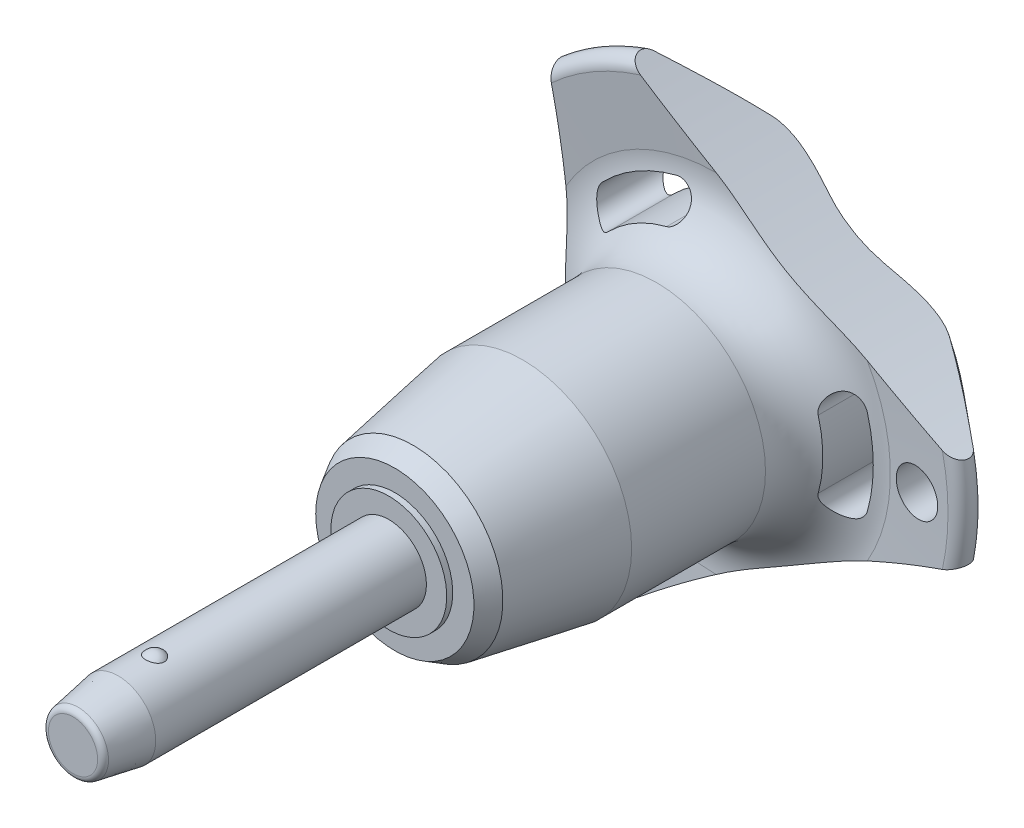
from build123d import *

# Parameters (mm, degrees)
SKETCH1_R           = 2.5
BOSS_EXTRUDE1_DEPTH = 15
SKETCH2_R           = 2.1
BOSS_EXTRUDE2_DEPTH = 26.7
BOSS_EXTRUDE3_START = 6
SKETCH1_2_R         = 2.5
BOSS_EXTRUDE3_DEPTH = 6
CHAMFER1_SIZE       = 3
CHAMFER1_SIZE2      = 0.528980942
FILLET1_R           = 0.4
SKETCH6_R           = 79.96
CUT_EXTRUDE1_DEPTH  = 48.854696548
CIRPATTERN1_COUNT   = 3
SKETCH7_R           = 1.5
CUT_EXTRUDE2_DEPTH  = 48.535566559


with BuildPart() as part:
    # Sketch1 → Boss-Extrude1 (new body)
    with BuildSketch(Plane.XY):
        Circle(SKETCH1_R)
    extrude(amount=-BOSS_EXTRUDE1_DEPTH)

    # Sketch2 → Boss-Extrude2 (add)
    with BuildSketch(Plane(origin=(0, 0, -15), x_dir=(-1, 0, 0), z_dir=(0, 0, -1))):
        Circle(SKETCH2_R)
    extrude(amount=BOSS_EXTRUDE2_DEPTH)

    # Sketch3 → Revolve1 (revolve)
    with BuildSketch(Plane(origin=(0, 0, 0), x_dir=(0, 0, -1), z_dir=(1, 0, 0))):
        with BuildLine():
            Line((-0.580947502, 2.75), (-0.580947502, 1.15))
            ThreePointArc((-0.580947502, 1.15), (0.219052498, 1.95), (-0.580947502, 2.75))
        make_face()
        with BuildLine():
            Line((-0.580947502, -1.15), (-0.580947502, -2.75))
            ThreePointArc((-0.580947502, -2.75), (0.219052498, -1.95), (-0.580947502, -1.15))
        make_face()
    revolve(axis=Axis((0, -1.15, 0.580947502), (0, 1, 0)))

    # Sketch1_2 → Boss-Extrude3 (add)
    with BuildSketch(Plane.XY.offset(BOSS_EXTRUDE3_START)):
        Circle(SKETCH1_2_R)
    extrude(amount=-BOSS_EXTRUDE3_DEPTH)

    # Chamfer1
    chamfer1_edges = [part.edges().sort_by_distance(p)[0] for p in [
        (-2.5, 0, 6),
    ]]
    chamfer1_side = [part.faces().sort_by_distance(p)[0] for p in [
        (-2.5, 0, -4.5),
    ]]
    chamfer(chamfer1_edges, length=CHAMFER1_SIZE, length2=CHAMFER1_SIZE2, reference=chamfer1_side[0])

    # Fillet1
    fillet1_edges = [part.edges().sort_by_distance(p)[0] for p in [
        (-1.971019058, 0, 6),
        (2.1, 0, -41.7),
    ]]
    fillet(fillet1_edges, radius=FILLET1_R)

    # Sketch4 → Revolve2 (revolve)
    with BuildSketch(Plane(origin=(0, 0, 0), x_dir=(0, 0, -1), z_dir=(1, 0, 0)), mode=Mode.PRIVATE) as revolve2_sk:
        Polygon((15, 0), (15, 3.851837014), (15.4, 3.851837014), (15.4, 5.26161122), (16.620900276, 5.966498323), (23.9, 7.25), (32.8, 7.25), (32.8, 0), align=None)
    revolve(revolve2_sk.sketch.rotate(Axis((0, 0, -32.8), (0, 0, 1)), 90), axis=Axis((0, 0, -32.8), (0, 0, 1)))

    # Sketch5 → Revolve3 (revolve)
    with BuildSketch(Plane(origin=(0, 0, 0), x_dir=(0, 0, -1), z_dir=(1, 0, 0)), mode=Mode.PRIVATE) as revolve3_sk:
        with BuildLine():
            Line((36.78715932, 11.570250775), (36.452568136, 15.735949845))
            ThreePointArc((36.452568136, 15.735949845), (36.946485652, 16.540188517), (37.862835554, 16.314230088))
            Line((37.862835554, 16.314230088), (41.326414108, 12.186497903))
            ThreePointArc((41.326414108, 12.186497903), (41.7, 11.109282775), (41.261488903, 10.056825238))
            ThreePointArc((41.261488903, 10.056825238), (38.289873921, 5.413681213), (37.25, 0))
            Line((37.25, 0), (32.8, 0))
            Line((32.8, 0), (32.8, 7.25))
            ThreePointArc((32.8, 7.25), (35.739473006, 8.537160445), (36.78715932, 11.570250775))
        make_face()
    revolve(revolve3_sk.sketch.rotate(Axis((0, 0, -37.25), (0, 0, 1)), 90), axis=Axis((0, 0, -37.25), (0, 0, 1)))

    # Sketch6 → Cut-Extrude1 (cut, through all)
    with BuildSketch(Plane.XY):
        with Locations((-89.76, 0)):
            Circle(SKETCH6_R)
        with BuildLine():
            ThreePointArc((10.099921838, -2.834717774), (10.490188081, 0), (10.099921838, 2.834717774))
            ThreePointArc((10.099921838, 2.834717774), (8.768180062, 3.582738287), (8.020159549, 2.250996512))
            ThreePointArc((8.020159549, 2.250996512), (8.330062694, 0), (8.020159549, -2.250996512))
            ThreePointArc((8.020159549, -2.250996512), (8.768180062, -3.582738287), (10.099921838, -2.834717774))
        make_face()
    cut_extrude1 = extrude(amount=-CUT_EXTRUDE1_DEPTH, mode=Mode.SUBTRACT)

    # CirPattern1: Cut-Extrude1 ×3 about axis
    cirpattern1_axis = Axis((0, 0, 0), (0, 0, 1))
    for i in range(1, CIRPATTERN1_COUNT):
        add(cut_extrude1.rotate(cirpattern1_axis, i * 360 / CIRPATTERN1_COUNT), mode=Mode.SUBTRACT)

    # Sketch7 → Cut-Extrude2 (cut, through all)
    with BuildSketch(Plane.XY):
        with Locations(Location((13.490188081, 0, 0), (0, 0, 225.221865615))):
            Circle(SKETCH7_R)
    extrude(amount=-CUT_EXTRUDE2_DEPTH, mode=Mode.SUBTRACT)


solid = part.part
